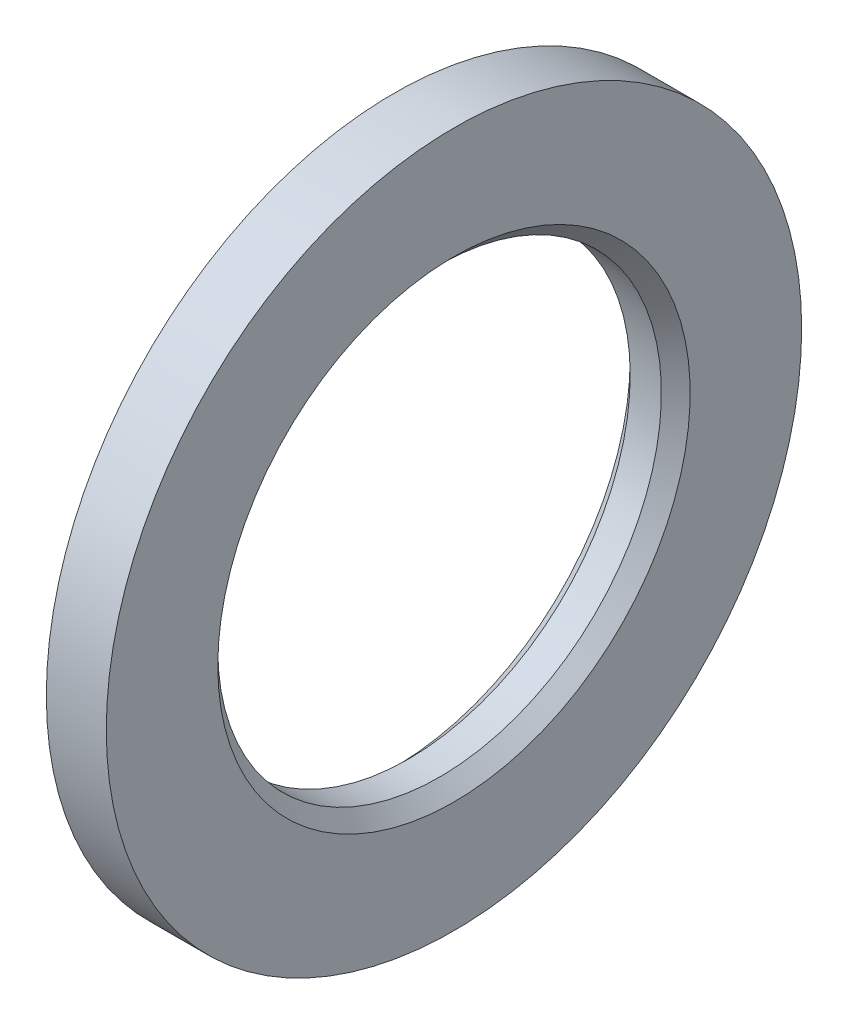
ISO-10303-21;
HEADER;
FILE_DESCRIPTION(('STEP AP214'),'2;1');
FILE_NAME('part.step','',(''),(''),'','','');
FILE_SCHEMA(('AUTOMOTIVE_DESIGN { 1 0 10303 214 1 1 1 1 }'));
ENDSEC;
DATA;
#1=APPLICATION_CONTEXT('core data for automotive mechanical design processes');
#2=APPLICATION_PROTOCOL_DEFINITION('international standard','automotive_design',2000,#1);
#3=PRODUCT_CONTEXT('',#1,'mechanical');
#4=PRODUCT('Part','Part','',(#3));
#5=PRODUCT_RELATED_PRODUCT_CATEGORY('part','',(#4));
#6=PRODUCT_DEFINITION_FORMATION('','',#4);
#7=PRODUCT_DEFINITION_CONTEXT('part definition',#1,'design');
#8=PRODUCT_DEFINITION('design','',#6,#7);
#9=PRODUCT_DEFINITION_SHAPE('','',#8);
#10=(LENGTH_UNIT() NAMED_UNIT(*) SI_UNIT(.MILLI.,.METRE.));
#11=(NAMED_UNIT(*) PLANE_ANGLE_UNIT() SI_UNIT($,.RADIAN.));
#12=(NAMED_UNIT(*) SI_UNIT($,.STERADIAN.) SOLID_ANGLE_UNIT());
#13=UNCERTAINTY_MEASURE_WITH_UNIT(LENGTH_MEASURE(1.E-05),#10,'distance_accuracy_value','');
#14=(GEOMETRIC_REPRESENTATION_CONTEXT(3) GLOBAL_UNCERTAINTY_ASSIGNED_CONTEXT((#13)) GLOBAL_UNIT_ASSIGNED_CONTEXT((#10,
#11,#12)) REPRESENTATION_CONTEXT('',''));
#15=CARTESIAN_POINT('',(0.,0.,0.));
#16=DIRECTION('',(0.,0.,1.));
#17=DIRECTION('',(1.,0.,0.));
#18=AXIS2_PLACEMENT_3D('',#15,#16,#17);
#19=CARTESIAN_POINT('',(-34.9249999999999,0.,0.));
#20=DIRECTION('',(-1.,0.,0.));
#21=DIRECTION('',(0.,0.,1.));
#22=AXIS2_PLACEMENT_3D('',#19,#20,#21);
#23=CYLINDRICAL_SURFACE('',#22,18.5);
#24=CARTESIAN_POINT('',(-3.8,0.,0.));
#25=DIRECTION('',(1.,0.,0.));
#26=DIRECTION('',(0.,0.,-1.));
#27=AXIS2_PLACEMENT_3D('',#24,#25,#26);
#28=CIRCLE('',#27,18.5);
#29=CARTESIAN_POINT('',(-3.8,0.,-18.5));
#30=VERTEX_POINT('',#29);
#31=EDGE_CURVE('E44',#30,#30,#28,.F.);
#32=ORIENTED_EDGE('',*,*,#31,.T.);
#33=EDGE_LOOP('',(#32));
#34=FACE_BOUND('',#33,.T.);
#35=CARTESIAN_POINT('',(-1.2,0.,0.));
#36=DIRECTION('',(-1.,0.,0.));
#37=DIRECTION('',(0.,0.,1.));
#38=AXIS2_PLACEMENT_3D('',#35,#36,#37);
#39=CIRCLE('',#38,18.5);
#40=CARTESIAN_POINT('',(-1.2,0.,18.5));
#41=VERTEX_POINT('',#40);
#42=EDGE_CURVE('E48',#41,#41,#39,.F.);
#43=ORIENTED_EDGE('',*,*,#42,.T.);
#44=EDGE_LOOP('',(#43));
#45=FACE_BOUND('',#44,.T.);
#46=ADVANCED_FACE('F37',(#34,#45),#23,.F.);
#47=CARTESIAN_POINT('',(0.,18.5,0.));
#48=DIRECTION('',(-1.,0.,0.));
#49=DIRECTION('',(0.,0.,1.));
#50=AXIS2_PLACEMENT_3D('',#47,#48,#49);
#51=PLANE('',#50);
#52=CARTESIAN_POINT('',(0.,0.,0.));
#53=DIRECTION('',(-1.,0.,0.));
#54=DIRECTION('',(0.,0.,1.));
#55=AXIS2_PLACEMENT_3D('',#52,#53,#54);
#56=CIRCLE('',#55,19.7);
#57=CARTESIAN_POINT('',(0.,0.,19.7));
#58=VERTEX_POINT('',#57);
#59=EDGE_CURVE('E52',#58,#58,#56,.T.);
#60=ORIENTED_EDGE('',*,*,#59,.T.);
#61=EDGE_LOOP('',(#60));
#62=FACE_BOUND('',#61,.T.);
#63=CARTESIAN_POINT('',(0.,0.,0.));
#64=DIRECTION('',(-1.,0.,0.));
#65=DIRECTION('',(0.,0.,1.));
#66=AXIS2_PLACEMENT_3D('',#63,#64,#65);
#67=CIRCLE('',#66,29.);
#68=CARTESIAN_POINT('',(0.,0.,29.));
#69=VERTEX_POINT('',#68);
#70=EDGE_CURVE('E57',#69,#69,#67,.T.);
#71=ORIENTED_EDGE('',*,*,#70,.F.);
#72=EDGE_LOOP('',(#71));
#73=FACE_BOUND('',#72,.T.);
#74=ADVANCED_FACE('F69',(#62,#73),#51,.F.);
#75=CARTESIAN_POINT('',(-34.9249999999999,0.,0.));
#76=DIRECTION('',(-1.,0.,0.));
#77=DIRECTION('',(0.,0.,1.));
#78=AXIS2_PLACEMENT_3D('',#75,#76,#77);
#79=CYLINDRICAL_SURFACE('',#78,29.);
#80=CARTESIAN_POINT('',(-5.,0.,0.));
#81=DIRECTION('',(-1.,0.,0.));
#82=DIRECTION('',(0.,0.,1.));
#83=AXIS2_PLACEMENT_3D('',#80,#81,#82);
#84=CIRCLE('',#83,29.);
#85=CARTESIAN_POINT('',(-5.,0.,29.));
#86=VERTEX_POINT('',#85);
#87=EDGE_CURVE('E60',#86,#86,#84,.T.);
#88=ORIENTED_EDGE('',*,*,#87,.F.);
#89=EDGE_LOOP('',(#88));
#90=FACE_BOUND('',#89,.T.);
#91=ORIENTED_EDGE('',*,*,#70,.T.);
#92=EDGE_LOOP('',(#91));
#93=FACE_BOUND('',#92,.T.);
#94=ADVANCED_FACE('F66',(#90,#93),#79,.T.);
#95=CARTESIAN_POINT('',(-5.,29.,0.));
#96=DIRECTION('',(1.,0.,0.));
#97=DIRECTION('',(0.,0.,-1.));
#98=AXIS2_PLACEMENT_3D('',#95,#96,#97);
#99=PLANE('',#98);
#100=CARTESIAN_POINT('',(-5.,0.,0.));
#101=DIRECTION('',(1.,0.,0.));
#102=DIRECTION('',(0.,0.,-1.));
#103=AXIS2_PLACEMENT_3D('',#100,#101,#102);
#104=CIRCLE('',#103,19.7);
#105=CARTESIAN_POINT('',(-5.,0.,-19.7));
#106=VERTEX_POINT('',#105);
#107=EDGE_CURVE('E10',#106,#106,#104,.T.);
#108=ORIENTED_EDGE('',*,*,#107,.T.);
#109=EDGE_LOOP('',(#108));
#110=FACE_BOUND('',#109,.T.);
#111=ORIENTED_EDGE('',*,*,#87,.T.);
#112=EDGE_LOOP('',(#111));
#113=FACE_BOUND('',#112,.T.);
#114=ADVANCED_FACE('F64',(#110,#113),#99,.F.);
#115=CARTESIAN_POINT('',(0.,0.,0.));
#116=DIRECTION('',(1.,0.,0.));
#117=DIRECTION('',(0.,0.,-1.));
#118=AXIS2_PLACEMENT_3D('',#115,#116,#117);
#119=CONICAL_SURFACE('',#118,19.7,0.78539816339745);
#120=ORIENTED_EDGE('',*,*,#42,.F.);
#121=EDGE_LOOP('',(#120));
#122=FACE_BOUND('',#121,.T.);
#123=ORIENTED_EDGE('',*,*,#59,.F.);
#124=EDGE_LOOP('',(#123));
#125=FACE_BOUND('',#124,.T.);
#126=ADVANCED_FACE('F82',(#122,#125),#119,.F.);
#127=CARTESIAN_POINT('',(-3.8,0.,0.));
#128=DIRECTION('',(-1.,0.,0.));
#129=DIRECTION('',(0.,0.,1.));
#130=AXIS2_PLACEMENT_3D('',#127,#128,#129);
#131=CONICAL_SURFACE('',#130,18.5,0.785398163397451);
#132=ORIENTED_EDGE('',*,*,#107,.F.);
#133=EDGE_LOOP('',(#132));
#134=FACE_BOUND('',#133,.T.);
#135=ORIENTED_EDGE('',*,*,#31,.F.);
#136=EDGE_LOOP('',(#135));
#137=FACE_BOUND('',#136,.T.);
#138=ADVANCED_FACE('F39',(#134,#137),#131,.F.);
#139=CLOSED_SHELL('',(#46,#74,#94,#114,#126,#138));
#140=MANIFOLD_SOLID_BREP('B2',#139);
#141=ADVANCED_BREP_SHAPE_REPRESENTATION('',(#18,#140),#14);
#142=SHAPE_DEFINITION_REPRESENTATION(#9,#141);
ENDSEC;
END-ISO-10303-21;
